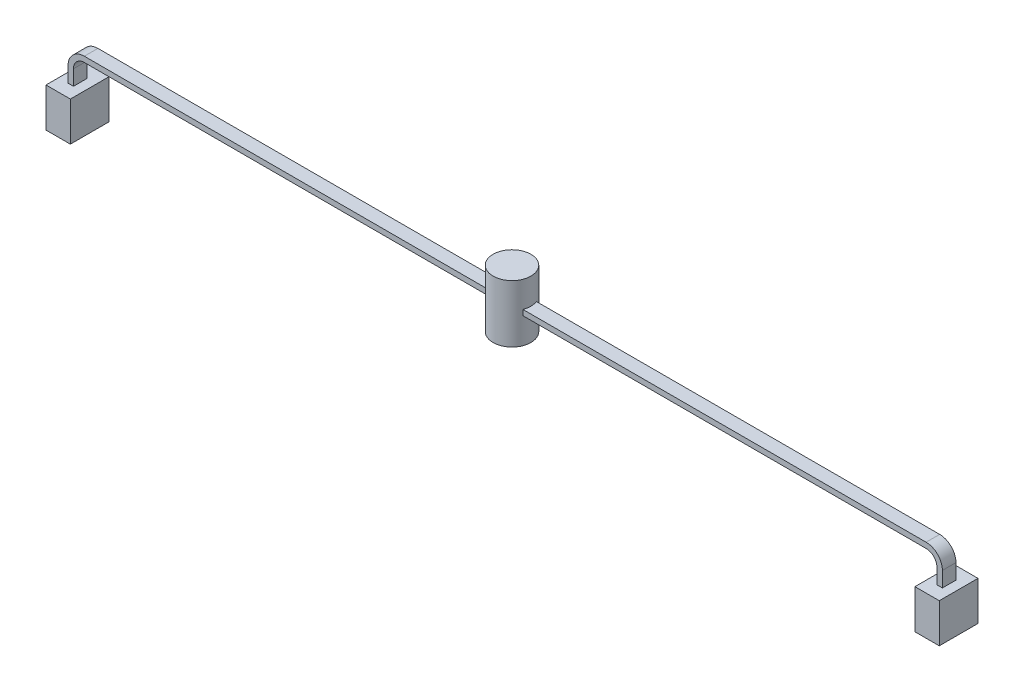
from build123d import *

# Parameters (mm, degrees)
SKETCH1_R           = 8.852557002
EXTRUDE1_DEPTH      = 13.462
EXTRUDE_THIN1_DEPTH = 3.175
SKETCH6_W           = 11.38904212
SKETCH6_H           = 18.11409486
EXTRUDE3_DEPTH      = 18.288


with BuildPart() as part:
    # Sketch1 → Extrude1 (new, symmetric)
    with BuildSketch(Plane(origin=(0, 0, 0), x_dir=(1, 0, 0), z_dir=(0, 1, 0))):
        with Locations(Location((0, 0, 0), (0, 0, 270))):
            Circle(SKETCH1_R)
    extrude(amount=EXTRUDE1_DEPTH, both=True)

    # Sketch5 → Extrude-Thin1 (add, symmetric)
    with BuildSketch(Plane.XY):
        with BuildLine():
            Line((0, -1.27), (196.85, -1.27))
            ThreePointArc((196.85, -1.27), (200.442102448, -2.757897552), (201.93, -6.35))
            Line((201.93, -6.35), (201.93, -13.462))
            Line((201.93, -13.462), (204.47, -13.462))
            Line((204.47, -13.462), (204.47, -6.35))
            ThreePointArc((204.47, -6.35), (202.238153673, -0.961846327), (196.85, 1.27))
            Line((196.85, 1.27), (0, 1.27))
            Line((0, 1.27), (0, -1.27))
        make_face()
    extrude_thin1 = extrude(amount=EXTRUDE_THIN1_DEPTH, both=True)

    # Sketch6 → Extrude3 (add)
    with BuildSketch(Plane.XZ.offset(13.462)):
        with Locations((203.2, 0)):
            Rectangle(SKETCH6_W, SKETCH6_H)
    extrude3 = extrude(amount=EXTRUDE3_DEPTH)

    # Mirror1: Extrude-Thin1, Extrude3 across plane
    add(extrude_thin1.mirror(Plane(origin=(0, 0, 0), x_dir=(0, 0, 1), z_dir=(1, 0, 0))))
    add(extrude3.mirror(Plane(origin=(0, 0, 0), x_dir=(0, 0, 1), z_dir=(1, 0, 0))))


solid = part.part
